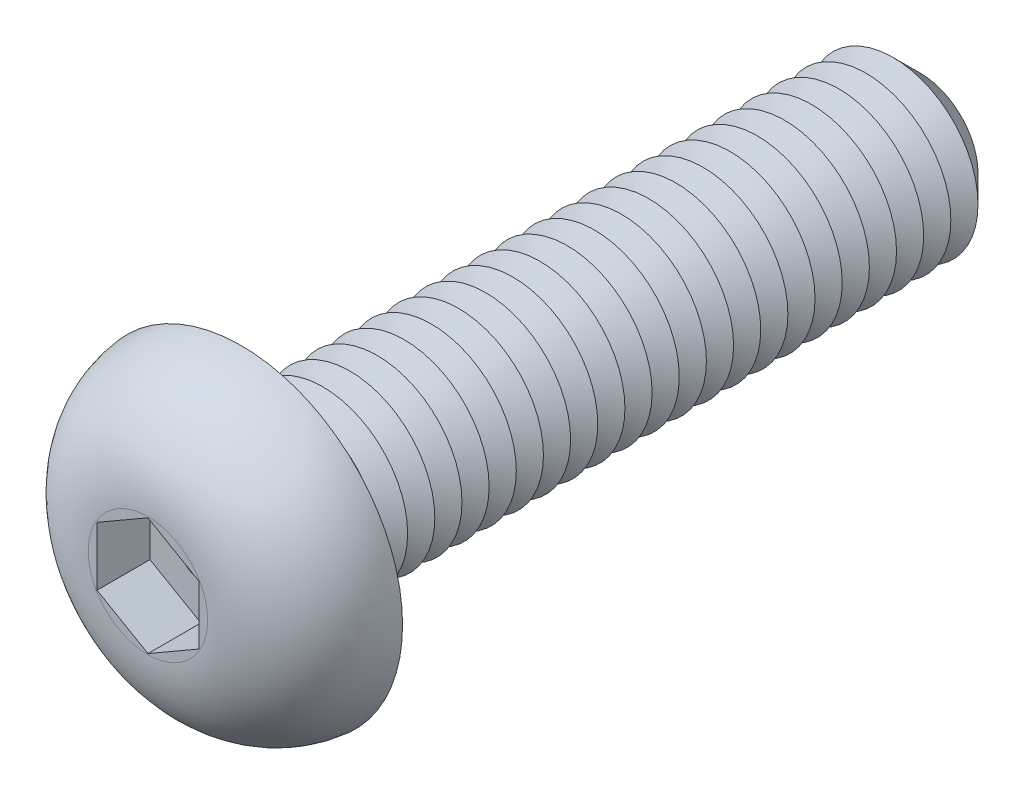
ISO-10303-21;
HEADER;
FILE_DESCRIPTION(('STEP AP214'),'2;1');
FILE_NAME('part.step','',(''),(''),'','','');
FILE_SCHEMA(('AUTOMOTIVE_DESIGN { 1 0 10303 214 1 1 1 1 }'));
ENDSEC;
DATA;
#1=APPLICATION_CONTEXT('core data for automotive mechanical design processes');
#2=APPLICATION_PROTOCOL_DEFINITION('international standard','automotive_design',2000,#1);
#3=PRODUCT_CONTEXT('',#1,'mechanical');
#4=PRODUCT('Part','Part','',(#3));
#5=PRODUCT_RELATED_PRODUCT_CATEGORY('part','',(#4));
#6=PRODUCT_DEFINITION_FORMATION('','',#4);
#7=PRODUCT_DEFINITION_CONTEXT('part definition',#1,'design');
#8=PRODUCT_DEFINITION('design','',#6,#7);
#9=PRODUCT_DEFINITION_SHAPE('','',#8);
#10=(LENGTH_UNIT() NAMED_UNIT(*) SI_UNIT(.MILLI.,.METRE.));
#11=(NAMED_UNIT(*) PLANE_ANGLE_UNIT() SI_UNIT($,.RADIAN.));
#12=(NAMED_UNIT(*) SI_UNIT($,.STERADIAN.) SOLID_ANGLE_UNIT());
#13=UNCERTAINTY_MEASURE_WITH_UNIT(LENGTH_MEASURE(1.E-05),#10,'distance_accuracy_value','');
#14=(GEOMETRIC_REPRESENTATION_CONTEXT(3) GLOBAL_UNCERTAINTY_ASSIGNED_CONTEXT((#13)) GLOBAL_UNIT_ASSIGNED_CONTEXT((#10,
#11,#12)) REPRESENTATION_CONTEXT('',''));
#15=CARTESIAN_POINT('',(0.,0.,0.));
#16=DIRECTION('',(0.,0.,1.));
#17=DIRECTION('',(1.,0.,0.));
#18=AXIS2_PLACEMENT_3D('',#15,#16,#17);
#19=CARTESIAN_POINT('',(0.,0.,-20.));
#20=DIRECTION('',(0.,0.,1.));
#21=DIRECTION('',(1.,0.,0.));
#22=AXIS2_PLACEMENT_3D('',#19,#20,#21);
#23=CYLINDRICAL_SURFACE('',#22,2.5);
#24=CARTESIAN_POINT('',(0.,0.,-0.400000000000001));
#25=DIRECTION('',(0.,0.,1.));
#26=DIRECTION('',(1.,0.,0.));
#27=AXIS2_PLACEMENT_3D('',#24,#25,#26);
#28=CIRCLE('',#27,2.5);
#29=CARTESIAN_POINT('',(2.5,0.,-0.400000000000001));
#30=VERTEX_POINT('',#29);
#31=EDGE_CURVE('E48',#30,#30,#28,.F.);
#32=ORIENTED_EDGE('',*,*,#31,.T.);
#33=EDGE_LOOP('',(#32));
#34=FACE_BOUND('',#33,.T.);
#35=CARTESIAN_POINT('',(0.,0.,-0.800000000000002));
#36=DIRECTION('',(0.,0.,1.));
#37=DIRECTION('',(1.,0.,0.));
#38=AXIS2_PLACEMENT_3D('',#35,#36,#37);
#39=CIRCLE('',#38,2.5);
#40=CARTESIAN_POINT('',(2.5,0.,-0.800000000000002));
#41=VERTEX_POINT('',#40);
#42=EDGE_CURVE('E137',#41,#41,#39,.T.);
#43=ORIENTED_EDGE('',*,*,#42,.T.);
#44=EDGE_LOOP('',(#43));
#45=FACE_BOUND('',#44,.T.);
#46=ADVANCED_FACE('F39',(#34,#45),#23,.T.);
#47=CARTESIAN_POINT('',(0.,4.75,0.));
#48=DIRECTION('',(0.,0.,1.));
#49=DIRECTION('',(1.,0.,0.));
#50=AXIS2_PLACEMENT_3D('',#47,#48,#49);
#51=PLANE('',#50);
#52=CARTESIAN_POINT('',(0.,0.,0.));
#53=DIRECTION('',(0.,0.,1.));
#54=DIRECTION('',(1.,0.,0.));
#55=AXIS2_PLACEMENT_3D('',#52,#53,#54);
#56=CIRCLE('',#55,2.9);
#57=CARTESIAN_POINT('',(2.9,0.,0.));
#58=VERTEX_POINT('',#57);
#59=EDGE_CURVE('E11',#58,#58,#56,.T.);
#60=ORIENTED_EDGE('',*,*,#59,.T.);
#61=EDGE_LOOP('',(#60));
#62=FACE_BOUND('',#61,.T.);
#63=CARTESIAN_POINT('',(0.,0.,0.));
#64=DIRECTION('',(0.,0.,1.));
#65=DIRECTION('',(1.,0.,0.));
#66=AXIS2_PLACEMENT_3D('',#63,#64,#65);
#67=CIRCLE('',#66,4.75);
#68=CARTESIAN_POINT('',(4.75,0.,0.));
#69=VERTEX_POINT('',#68);
#70=EDGE_CURVE('E156',#69,#69,#67,.T.);
#71=ORIENTED_EDGE('',*,*,#70,.F.);
#72=EDGE_LOOP('',(#71));
#73=FACE_BOUND('',#72,.T.);
#74=ADVANCED_FACE('F197',(#62,#73),#51,.F.);
#75=CARTESIAN_POINT('',(0.,0.,2.75));
#76=DIRECTION('',(0.,0.,-1.));
#77=DIRECTION('',(-1.,0.,0.));
#78=AXIS2_PLACEMENT_3D('',#75,#76,#77);
#79=PLANE('',#78);
#80=DIRECTION('',(-0.866025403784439,-0.5,0.));
#81=VECTOR('',#80,1.);
#82=CARTESIAN_POINT('',(0.,1.73205080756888,2.75));
#83=LINE('',#82,#81);
#84=CARTESIAN_POINT('',(0.,1.73205080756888,2.75));
#85=VERTEX_POINT('',#84);
#86=CARTESIAN_POINT('',(-1.5,0.866025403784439,2.75));
#87=VERTEX_POINT('',#86);
#88=EDGE_CURVE('E136',#85,#87,#83,.T.);
#89=ORIENTED_EDGE('',*,*,#88,.F.);
#90=DIRECTION('',(-0.866025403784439,0.5,0.));
#91=VECTOR('',#90,1.);
#92=CARTESIAN_POINT('',(1.5,0.86602540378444,2.75));
#93=LINE('',#92,#91);
#94=CARTESIAN_POINT('',(1.5,0.86602540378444,2.75));
#95=VERTEX_POINT('',#94);
#96=EDGE_CURVE('E55',#95,#85,#93,.T.);
#97=ORIENTED_EDGE('',*,*,#96,.F.);
#98=DIRECTION('',(0.,1.,0.));
#99=VECTOR('',#98,1.);
#100=CARTESIAN_POINT('',(1.5,-0.866025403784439,2.75));
#101=LINE('',#100,#99);
#102=CARTESIAN_POINT('',(1.5,-0.866025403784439,2.75));
#103=VERTEX_POINT('',#102);
#104=EDGE_CURVE('E150',#103,#95,#101,.T.);
#105=ORIENTED_EDGE('',*,*,#104,.F.);
#106=DIRECTION('',(0.866025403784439,0.5,0.));
#107=VECTOR('',#106,1.);
#108=CARTESIAN_POINT('',(0.,-1.73205080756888,2.75));
#109=LINE('',#108,#107);
#110=CARTESIAN_POINT('',(0.,-1.73205080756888,2.75));
#111=VERTEX_POINT('',#110);
#112=EDGE_CURVE('E147',#111,#103,#109,.T.);
#113=ORIENTED_EDGE('',*,*,#112,.F.);
#114=DIRECTION('',(0.866025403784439,-0.5,0.));
#115=VECTOR('',#114,1.);
#116=CARTESIAN_POINT('',(-1.5,-0.866025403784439,2.75));
#117=LINE('',#116,#115);
#118=CARTESIAN_POINT('',(-1.5,-0.866025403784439,2.75));
#119=VERTEX_POINT('',#118);
#120=EDGE_CURVE('E103',#119,#111,#117,.T.);
#121=ORIENTED_EDGE('',*,*,#120,.F.);
#122=DIRECTION('',(0.,-1.,0.));
#123=VECTOR('',#122,1.);
#124=CARTESIAN_POINT('',(-1.5,0.866025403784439,2.75));
#125=LINE('',#124,#123);
#126=EDGE_CURVE('E141',#87,#119,#125,.T.);
#127=ORIENTED_EDGE('',*,*,#126,.F.);
#128=EDGE_LOOP('',(#89,#97,#105,#113,#121,#127));
#129=FACE_BOUND('',#128,.T.);
#130=CARTESIAN_POINT('',(0.,0.,2.75));
#131=DIRECTION('',(0.,0.,1.));
#132=DIRECTION('',(1.,0.,0.));
#133=AXIS2_PLACEMENT_3D('',#130,#131,#132);
#134=CIRCLE('',#133,1.76043481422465);
#135=CARTESIAN_POINT('',(1.76043481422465,0.,2.75));
#136=VERTEX_POINT('',#135);
#137=EDGE_CURVE('E169',#136,#136,#134,.T.);
#138=ORIENTED_EDGE('',*,*,#137,.T.);
#139=EDGE_LOOP('',(#138));
#140=FACE_BOUND('',#139,.T.);
#141=ADVANCED_FACE('F202',(#129,#140),#79,.F.);
#142=CARTESIAN_POINT('',(0.,0.,-0.25));
#143=DIRECTION('',(0.,0.,1.));
#144=DIRECTION('',(1.,0.,0.));
#145=AXIS2_PLACEMENT_3D('',#142,#143,#144);
#146=DEGENERATE_TOROIDAL_SURFACE('',#145,1.76043481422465,3.,.T.);
#147=ORIENTED_EDGE('',*,*,#137,.F.);
#148=EDGE_LOOP('',(#147));
#149=FACE_BOUND('',#148,.T.);
#150=ORIENTED_EDGE('',*,*,#70,.T.);
#151=EDGE_LOOP('',(#150));
#152=FACE_BOUND('',#151,.T.);
#153=ADVANCED_FACE('F230',(#149,#152),#146,.T.);
#154=CARTESIAN_POINT('',(1.5,0.86602540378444,1.19));
#155=DIRECTION('',(0.5,0.866025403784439,0.));
#156=DIRECTION('',(-0.866025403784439,0.5,0.));
#157=AXIS2_PLACEMENT_3D('',#154,#155,#156);
#158=PLANE('',#157);
#159=ORIENTED_EDGE('',*,*,#96,.T.);
#160=DIRECTION('',(0.,0.,1.));
#161=VECTOR('',#160,1.);
#162=CARTESIAN_POINT('',(0.,1.73205080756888,1.19));
#163=LINE('',#162,#161);
#164=CARTESIAN_POINT('',(0.,1.73205080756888,1.19));
#165=VERTEX_POINT('',#164);
#166=EDGE_CURVE('E85',#165,#85,#163,.T.);
#167=ORIENTED_EDGE('',*,*,#166,.F.);
#168=DIRECTION('',(-0.866025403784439,0.5,0.));
#169=VECTOR('',#168,1.);
#170=CARTESIAN_POINT('',(1.5,0.86602540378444,1.19));
#171=LINE('',#170,#169);
#172=CARTESIAN_POINT('',(1.5,0.86602540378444,1.19));
#173=VERTEX_POINT('',#172);
#174=EDGE_CURVE('E153',#173,#165,#171,.T.);
#175=ORIENTED_EDGE('',*,*,#174,.F.);
#176=DIRECTION('',(0.,0.,1.));
#177=VECTOR('',#176,1.);
#178=CARTESIAN_POINT('',(1.5,0.86602540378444,1.19));
#179=LINE('',#178,#177);
#180=EDGE_CURVE('E63',#173,#95,#179,.T.);
#181=ORIENTED_EDGE('',*,*,#180,.T.);
#182=EDGE_LOOP('',(#159,#167,#175,#181));
#183=FACE_BOUND('',#182,.T.);
#184=ADVANCED_FACE('F216',(#183),#158,.F.);
#185=CARTESIAN_POINT('',(1.5,-0.866025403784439,1.19));
#186=DIRECTION('',(1.,0.,0.));
#187=DIRECTION('',(0.,1.,0.));
#188=AXIS2_PLACEMENT_3D('',#185,#186,#187);
#189=PLANE('',#188);
#190=ORIENTED_EDGE('',*,*,#104,.T.);
#191=ORIENTED_EDGE('',*,*,#180,.F.);
#192=DIRECTION('',(0.,1.,0.));
#193=VECTOR('',#192,1.);
#194=CARTESIAN_POINT('',(1.5,-0.866025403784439,1.19));
#195=LINE('',#194,#193);
#196=CARTESIAN_POINT('',(1.5,-0.866025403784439,1.19));
#197=VERTEX_POINT('',#196);
#198=EDGE_CURVE('E117',#197,#173,#195,.T.);
#199=ORIENTED_EDGE('',*,*,#198,.F.);
#200=DIRECTION('',(0.,0.,1.));
#201=VECTOR('',#200,1.);
#202=CARTESIAN_POINT('',(1.5,-0.866025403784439,1.19));
#203=LINE('',#202,#201);
#204=EDGE_CURVE('E108',#197,#103,#203,.T.);
#205=ORIENTED_EDGE('',*,*,#204,.T.);
#206=EDGE_LOOP('',(#190,#191,#199,#205));
#207=FACE_BOUND('',#206,.T.);
#208=ADVANCED_FACE('F213',(#207),#189,.F.);
#209=CARTESIAN_POINT('',(0.,-1.73205080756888,1.19));
#210=DIRECTION('',(0.5,-0.866025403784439,0.));
#211=DIRECTION('',(0.866025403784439,0.5,0.));
#212=AXIS2_PLACEMENT_3D('',#209,#210,#211);
#213=PLANE('',#212);
#214=ORIENTED_EDGE('',*,*,#112,.T.);
#215=ORIENTED_EDGE('',*,*,#204,.F.);
#216=DIRECTION('',(0.866025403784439,0.5,0.));
#217=VECTOR('',#216,1.);
#218=CARTESIAN_POINT('',(0.,-1.73205080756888,1.19));
#219=LINE('',#218,#217);
#220=CARTESIAN_POINT('',(0.,-1.73205080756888,1.19));
#221=VERTEX_POINT('',#220);
#222=EDGE_CURVE('E112',#221,#197,#219,.T.);
#223=ORIENTED_EDGE('',*,*,#222,.F.);
#224=DIRECTION('',(0.,0.,1.));
#225=VECTOR('',#224,1.);
#226=CARTESIAN_POINT('',(0.,-1.73205080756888,1.19));
#227=LINE('',#226,#225);
#228=EDGE_CURVE('E96',#221,#111,#227,.T.);
#229=ORIENTED_EDGE('',*,*,#228,.T.);
#230=EDGE_LOOP('',(#214,#215,#223,#229));
#231=FACE_BOUND('',#230,.T.);
#232=ADVANCED_FACE('F113',(#231),#213,.F.);
#233=CARTESIAN_POINT('',(-1.5,-0.866025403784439,1.19));
#234=DIRECTION('',(-0.5,-0.866025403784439,0.));
#235=DIRECTION('',(0.866025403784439,-0.5,0.));
#236=AXIS2_PLACEMENT_3D('',#233,#234,#235);
#237=PLANE('',#236);
#238=ORIENTED_EDGE('',*,*,#120,.T.);
#239=ORIENTED_EDGE('',*,*,#228,.F.);
#240=DIRECTION('',(0.866025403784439,-0.5,0.));
#241=VECTOR('',#240,1.);
#242=CARTESIAN_POINT('',(-1.5,-0.866025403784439,1.19));
#243=LINE('',#242,#241);
#244=CARTESIAN_POINT('',(-1.5,-0.866025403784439,1.19));
#245=VERTEX_POINT('',#244);
#246=EDGE_CURVE('E100',#245,#221,#243,.T.);
#247=ORIENTED_EDGE('',*,*,#246,.F.);
#248=DIRECTION('',(0.,0.,1.));
#249=VECTOR('',#248,1.);
#250=CARTESIAN_POINT('',(-1.5,-0.866025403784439,1.19));
#251=LINE('',#250,#249);
#252=EDGE_CURVE('E109',#245,#119,#251,.T.);
#253=ORIENTED_EDGE('',*,*,#252,.T.);
#254=EDGE_LOOP('',(#238,#239,#247,#253));
#255=FACE_BOUND('',#254,.T.);
#256=ADVANCED_FACE('F98',(#255),#237,.F.);
#257=CARTESIAN_POINT('',(-1.5,0.866025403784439,1.19));
#258=DIRECTION('',(-1.,0.,0.));
#259=DIRECTION('',(0.,-1.,0.));
#260=AXIS2_PLACEMENT_3D('',#257,#258,#259);
#261=PLANE('',#260);
#262=ORIENTED_EDGE('',*,*,#126,.T.);
#263=ORIENTED_EDGE('',*,*,#252,.F.);
#264=DIRECTION('',(0.,-1.,0.));
#265=VECTOR('',#264,1.);
#266=CARTESIAN_POINT('',(-1.5,0.866025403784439,1.19));
#267=LINE('',#266,#265);
#268=CARTESIAN_POINT('',(-1.5,0.866025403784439,1.19));
#269=VERTEX_POINT('',#268);
#270=EDGE_CURVE('E123',#269,#245,#267,.T.);
#271=ORIENTED_EDGE('',*,*,#270,.F.);
#272=DIRECTION('',(0.,0.,1.));
#273=VECTOR('',#272,1.);
#274=CARTESIAN_POINT('',(-1.5,0.866025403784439,1.19));
#275=LINE('',#274,#273);
#276=EDGE_CURVE('E161',#269,#87,#275,.T.);
#277=ORIENTED_EDGE('',*,*,#276,.T.);
#278=EDGE_LOOP('',(#262,#263,#271,#277));
#279=FACE_BOUND('',#278,.T.);
#280=ADVANCED_FACE('F221',(#279),#261,.F.);
#281=CARTESIAN_POINT('',(0.,1.73205080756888,1.19));
#282=DIRECTION('',(-0.5,0.866025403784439,0.));
#283=DIRECTION('',(-0.866025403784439,-0.5,0.));
#284=AXIS2_PLACEMENT_3D('',#281,#282,#283);
#285=PLANE('',#284);
#286=ORIENTED_EDGE('',*,*,#88,.T.);
#287=ORIENTED_EDGE('',*,*,#276,.F.);
#288=DIRECTION('',(-0.866025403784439,-0.5,0.));
#289=VECTOR('',#288,1.);
#290=CARTESIAN_POINT('',(0.,1.73205080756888,1.19));
#291=LINE('',#290,#289);
#292=EDGE_CURVE('E129',#165,#269,#291,.T.);
#293=ORIENTED_EDGE('',*,*,#292,.F.);
#294=ORIENTED_EDGE('',*,*,#166,.T.);
#295=EDGE_LOOP('',(#286,#287,#293,#294));
#296=FACE_BOUND('',#295,.T.);
#297=ADVANCED_FACE('F211',(#296),#285,.F.);
#298=CARTESIAN_POINT('',(0.,0.,1.19));
#299=DIRECTION('',(0.,0.,1.));
#300=DIRECTION('',(1.,0.,0.));
#301=AXIS2_PLACEMENT_3D('',#298,#299,#300);
#302=PLANE('',#301);
#303=CARTESIAN_POINT('',(0.,0.,1.19));
#304=DIRECTION('',(0.,0.,1.));
#305=DIRECTION('',(1.,0.,0.));
#306=AXIS2_PLACEMENT_3D('',#303,#304,#305);
#307=CIRCLE('',#306,0.65);
#308=CARTESIAN_POINT('',(0.65,0.,1.19));
#309=VERTEX_POINT('',#308);
#310=EDGE_CURVE('E439',#309,#309,#307,.T.);
#311=ORIENTED_EDGE('',*,*,#310,.F.);
#312=EDGE_LOOP('',(#311));
#313=FACE_BOUND('',#312,.T.);
#314=ORIENTED_EDGE('',*,*,#174,.T.);
#315=ORIENTED_EDGE('',*,*,#292,.T.);
#316=ORIENTED_EDGE('',*,*,#270,.T.);
#317=ORIENTED_EDGE('',*,*,#246,.T.);
#318=ORIENTED_EDGE('',*,*,#222,.T.);
#319=ORIENTED_EDGE('',*,*,#198,.T.);
#320=EDGE_LOOP('',(#314,#315,#316,#317,#318,#319));
#321=FACE_BOUND('',#320,.T.);
#322=ADVANCED_FACE('F120',(#313,#321),#302,.T.);
#323=CARTESIAN_POINT('',(0.,0.,-0.800000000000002));
#324=DIRECTION('',(0.,0.,1.));
#325=DIRECTION('',(1.,0.,0.));
#326=AXIS2_PLACEMENT_3D('',#323,#324,#325);
#327=CONICAL_SURFACE('',#326,2.5,1.0471975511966);
#328=CARTESIAN_POINT('',(0.,0.,-1.2));
#329=DIRECTION('',(0.,0.,1.));
#330=DIRECTION('',(1.,0.,0.));
#331=AXIS2_PLACEMENT_3D('',#328,#329,#330);
#332=CIRCLE('',#331,1.80717967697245);
#333=CARTESIAN_POINT('',(1.80717967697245,0.,-1.2));
#334=VERTEX_POINT('',#333);
#335=EDGE_CURVE('E255',#334,#334,#332,.T.);
#336=ORIENTED_EDGE('',*,*,#335,.T.);
#337=EDGE_LOOP('',(#336));
#338=FACE_BOUND('',#337,.T.);
#339=ORIENTED_EDGE('',*,*,#42,.F.);
#340=EDGE_LOOP('',(#339));
#341=FACE_BOUND('',#340,.T.);
#342=ADVANCED_FACE('F210',(#338,#341),#327,.T.);
#343=CARTESIAN_POINT('',(0.,0.,-1.2));
#344=DIRECTION('',(0.,0.,-1.));
#345=DIRECTION('',(-1.,0.,0.));
#346=AXIS2_PLACEMENT_3D('',#343,#344,#345);
#347=CONICAL_SURFACE('',#346,1.80717967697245,1.0471975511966);
#348=CARTESIAN_POINT('',(0.,0.,-1.6));
#349=DIRECTION('',(0.,0.,1.));
#350=DIRECTION('',(1.,0.,0.));
#351=AXIS2_PLACEMENT_3D('',#348,#349,#350);
#352=CIRCLE('',#351,2.5);
#353=CARTESIAN_POINT('',(2.5,0.,-1.6));
#354=VERTEX_POINT('',#353);
#355=EDGE_CURVE('E259',#354,#354,#352,.T.);
#356=ORIENTED_EDGE('',*,*,#355,.T.);
#357=EDGE_LOOP('',(#356));
#358=FACE_BOUND('',#357,.T.);
#359=ORIENTED_EDGE('',*,*,#335,.F.);
#360=EDGE_LOOP('',(#359));
#361=FACE_BOUND('',#360,.T.);
#362=ADVANCED_FACE('F631',(#358,#361),#347,.T.);
#363=CARTESIAN_POINT('',(0.,0.,-1.6));
#364=DIRECTION('',(0.,0.,1.));
#365=DIRECTION('',(1.,0.,0.));
#366=AXIS2_PLACEMENT_3D('',#363,#364,#365);
#367=CONICAL_SURFACE('',#366,2.5,1.0471975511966);
#368=CARTESIAN_POINT('',(0.,0.,-2.));
#369=DIRECTION('',(0.,0.,1.));
#370=DIRECTION('',(1.,0.,0.));
#371=AXIS2_PLACEMENT_3D('',#368,#369,#370);
#372=CIRCLE('',#371,1.80717967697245);
#373=CARTESIAN_POINT('',(1.80717967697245,0.,-2.));
#374=VERTEX_POINT('',#373);
#375=EDGE_CURVE('E262',#374,#374,#372,.T.);
#376=ORIENTED_EDGE('',*,*,#375,.T.);
#377=EDGE_LOOP('',(#376));
#378=FACE_BOUND('',#377,.T.);
#379=ORIENTED_EDGE('',*,*,#355,.F.);
#380=EDGE_LOOP('',(#379));
#381=FACE_BOUND('',#380,.T.);
#382=ADVANCED_FACE('F627',(#378,#381),#367,.T.);
#383=CARTESIAN_POINT('',(0.,0.,-2.));
#384=DIRECTION('',(0.,0.,-1.));
#385=DIRECTION('',(-1.,0.,0.));
#386=AXIS2_PLACEMENT_3D('',#383,#384,#385);
#387=CONICAL_SURFACE('',#386,1.80717967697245,1.0471975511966);
#388=CARTESIAN_POINT('',(0.,0.,-2.4));
#389=DIRECTION('',(0.,0.,1.));
#390=DIRECTION('',(1.,0.,0.));
#391=AXIS2_PLACEMENT_3D('',#388,#389,#390);
#392=CIRCLE('',#391,2.5);
#393=CARTESIAN_POINT('',(2.5,0.,-2.4));
#394=VERTEX_POINT('',#393);
#395=EDGE_CURVE('E266',#394,#394,#392,.T.);
#396=ORIENTED_EDGE('',*,*,#395,.T.);
#397=EDGE_LOOP('',(#396));
#398=FACE_BOUND('',#397,.T.);
#399=ORIENTED_EDGE('',*,*,#375,.F.);
#400=EDGE_LOOP('',(#399));
#401=FACE_BOUND('',#400,.T.);
#402=ADVANCED_FACE('F623',(#398,#401),#387,.T.);
#403=CARTESIAN_POINT('',(0.,0.,-2.4));
#404=DIRECTION('',(0.,0.,1.));
#405=DIRECTION('',(1.,0.,0.));
#406=AXIS2_PLACEMENT_3D('',#403,#404,#405);
#407=CONICAL_SURFACE('',#406,2.5,1.0471975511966);
#408=CARTESIAN_POINT('',(0.,0.,-2.8));
#409=DIRECTION('',(0.,0.,1.));
#410=DIRECTION('',(1.,0.,0.));
#411=AXIS2_PLACEMENT_3D('',#408,#409,#410);
#412=CIRCLE('',#411,1.80717967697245);
#413=CARTESIAN_POINT('',(1.80717967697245,0.,-2.8));
#414=VERTEX_POINT('',#413);
#415=EDGE_CURVE('E269',#414,#414,#412,.T.);
#416=ORIENTED_EDGE('',*,*,#415,.T.);
#417=EDGE_LOOP('',(#416));
#418=FACE_BOUND('',#417,.T.);
#419=ORIENTED_EDGE('',*,*,#395,.F.);
#420=EDGE_LOOP('',(#419));
#421=FACE_BOUND('',#420,.T.);
#422=ADVANCED_FACE('F619',(#418,#421),#407,.T.);
#423=CARTESIAN_POINT('',(0.,0.,-2.8));
#424=DIRECTION('',(0.,0.,-1.));
#425=DIRECTION('',(-1.,0.,0.));
#426=AXIS2_PLACEMENT_3D('',#423,#424,#425);
#427=CONICAL_SURFACE('',#426,1.80717967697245,1.0471975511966);
#428=CARTESIAN_POINT('',(0.,0.,-3.2));
#429=DIRECTION('',(0.,0.,1.));
#430=DIRECTION('',(1.,0.,0.));
#431=AXIS2_PLACEMENT_3D('',#428,#429,#430);
#432=CIRCLE('',#431,2.5);
#433=CARTESIAN_POINT('',(2.5,0.,-3.2));
#434=VERTEX_POINT('',#433);
#435=EDGE_CURVE('E273',#434,#434,#432,.T.);
#436=ORIENTED_EDGE('',*,*,#435,.T.);
#437=EDGE_LOOP('',(#436));
#438=FACE_BOUND('',#437,.T.);
#439=ORIENTED_EDGE('',*,*,#415,.F.);
#440=EDGE_LOOP('',(#439));
#441=FACE_BOUND('',#440,.T.);
#442=ADVANCED_FACE('F615',(#438,#441),#427,.T.);
#443=CARTESIAN_POINT('',(0.,0.,-3.2));
#444=DIRECTION('',(0.,0.,1.));
#445=DIRECTION('',(1.,0.,0.));
#446=AXIS2_PLACEMENT_3D('',#443,#444,#445);
#447=CONICAL_SURFACE('',#446,2.5,1.0471975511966);
#448=CARTESIAN_POINT('',(0.,0.,-3.6));
#449=DIRECTION('',(0.,0.,1.));
#450=DIRECTION('',(1.,0.,0.));
#451=AXIS2_PLACEMENT_3D('',#448,#449,#450);
#452=CIRCLE('',#451,1.80717967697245);
#453=CARTESIAN_POINT('',(1.80717967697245,0.,-3.6));
#454=VERTEX_POINT('',#453);
#455=EDGE_CURVE('E277',#454,#454,#452,.T.);
#456=ORIENTED_EDGE('',*,*,#455,.T.);
#457=EDGE_LOOP('',(#456));
#458=FACE_BOUND('',#457,.T.);
#459=ORIENTED_EDGE('',*,*,#435,.F.);
#460=EDGE_LOOP('',(#459));
#461=FACE_BOUND('',#460,.T.);
#462=ADVANCED_FACE('F611',(#458,#461),#447,.T.);
#463=CARTESIAN_POINT('',(0.,0.,-3.6));
#464=DIRECTION('',(0.,0.,-1.));
#465=DIRECTION('',(-1.,0.,0.));
#466=AXIS2_PLACEMENT_3D('',#463,#464,#465);
#467=CONICAL_SURFACE('',#466,1.80717967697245,1.0471975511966);
#468=CARTESIAN_POINT('',(0.,0.,-4.));
#469=DIRECTION('',(0.,0.,1.));
#470=DIRECTION('',(1.,0.,0.));
#471=AXIS2_PLACEMENT_3D('',#468,#469,#470);
#472=CIRCLE('',#471,2.5);
#473=CARTESIAN_POINT('',(2.5,0.,-4.));
#474=VERTEX_POINT('',#473);
#475=EDGE_CURVE('E281',#474,#474,#472,.T.);
#476=ORIENTED_EDGE('',*,*,#475,.T.);
#477=EDGE_LOOP('',(#476));
#478=FACE_BOUND('',#477,.T.);
#479=ORIENTED_EDGE('',*,*,#455,.F.);
#480=EDGE_LOOP('',(#479));
#481=FACE_BOUND('',#480,.T.);
#482=ADVANCED_FACE('F607',(#478,#481),#467,.T.);
#483=CARTESIAN_POINT('',(0.,0.,-4.));
#484=DIRECTION('',(0.,0.,1.));
#485=DIRECTION('',(1.,0.,0.));
#486=AXIS2_PLACEMENT_3D('',#483,#484,#485);
#487=CONICAL_SURFACE('',#486,2.5,1.0471975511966);
#488=CARTESIAN_POINT('',(0.,0.,-4.4));
#489=DIRECTION('',(0.,0.,1.));
#490=DIRECTION('',(1.,0.,0.));
#491=AXIS2_PLACEMENT_3D('',#488,#489,#490);
#492=CIRCLE('',#491,1.80717967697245);
#493=CARTESIAN_POINT('',(1.80717967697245,0.,-4.4));
#494=VERTEX_POINT('',#493);
#495=EDGE_CURVE('E285',#494,#494,#492,.T.);
#496=ORIENTED_EDGE('',*,*,#495,.T.);
#497=EDGE_LOOP('',(#496));
#498=FACE_BOUND('',#497,.T.);
#499=ORIENTED_EDGE('',*,*,#475,.F.);
#500=EDGE_LOOP('',(#499));
#501=FACE_BOUND('',#500,.T.);
#502=ADVANCED_FACE('F603',(#498,#501),#487,.T.);
#503=CARTESIAN_POINT('',(0.,0.,-4.4));
#504=DIRECTION('',(0.,0.,-1.));
#505=DIRECTION('',(-1.,0.,0.));
#506=AXIS2_PLACEMENT_3D('',#503,#504,#505);
#507=CONICAL_SURFACE('',#506,1.80717967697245,1.0471975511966);
#508=CARTESIAN_POINT('',(0.,0.,-4.8));
#509=DIRECTION('',(0.,0.,1.));
#510=DIRECTION('',(1.,0.,0.));
#511=AXIS2_PLACEMENT_3D('',#508,#509,#510);
#512=CIRCLE('',#511,2.5);
#513=CARTESIAN_POINT('',(2.5,0.,-4.8));
#514=VERTEX_POINT('',#513);
#515=EDGE_CURVE('E289',#514,#514,#512,.T.);
#516=ORIENTED_EDGE('',*,*,#515,.T.);
#517=EDGE_LOOP('',(#516));
#518=FACE_BOUND('',#517,.T.);
#519=ORIENTED_EDGE('',*,*,#495,.F.);
#520=EDGE_LOOP('',(#519));
#521=FACE_BOUND('',#520,.T.);
#522=ADVANCED_FACE('F599',(#518,#521),#507,.T.);
#523=CARTESIAN_POINT('',(0.,0.,-4.8));
#524=DIRECTION('',(0.,0.,1.));
#525=DIRECTION('',(1.,0.,0.));
#526=AXIS2_PLACEMENT_3D('',#523,#524,#525);
#527=CONICAL_SURFACE('',#526,2.5,1.0471975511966);
#528=CARTESIAN_POINT('',(0.,0.,-5.2));
#529=DIRECTION('',(0.,0.,1.));
#530=DIRECTION('',(1.,0.,0.));
#531=AXIS2_PLACEMENT_3D('',#528,#529,#530);
#532=CIRCLE('',#531,1.80717967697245);
#533=CARTESIAN_POINT('',(1.80717967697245,0.,-5.2));
#534=VERTEX_POINT('',#533);
#535=EDGE_CURVE('E293',#534,#534,#532,.T.);
#536=ORIENTED_EDGE('',*,*,#535,.T.);
#537=EDGE_LOOP('',(#536));
#538=FACE_BOUND('',#537,.T.);
#539=ORIENTED_EDGE('',*,*,#515,.F.);
#540=EDGE_LOOP('',(#539));
#541=FACE_BOUND('',#540,.T.);
#542=ADVANCED_FACE('F595',(#538,#541),#527,.T.);
#543=CARTESIAN_POINT('',(0.,0.,-5.2));
#544=DIRECTION('',(0.,0.,-1.));
#545=DIRECTION('',(-1.,0.,0.));
#546=AXIS2_PLACEMENT_3D('',#543,#544,#545);
#547=CONICAL_SURFACE('',#546,1.80717967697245,1.0471975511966);
#548=CARTESIAN_POINT('',(0.,0.,-5.6));
#549=DIRECTION('',(0.,0.,1.));
#550=DIRECTION('',(1.,0.,0.));
#551=AXIS2_PLACEMENT_3D('',#548,#549,#550);
#552=CIRCLE('',#551,2.5);
#553=CARTESIAN_POINT('',(2.5,0.,-5.6));
#554=VERTEX_POINT('',#553);
#555=EDGE_CURVE('E297',#554,#554,#552,.T.);
#556=ORIENTED_EDGE('',*,*,#555,.T.);
#557=EDGE_LOOP('',(#556));
#558=FACE_BOUND('',#557,.T.);
#559=ORIENTED_EDGE('',*,*,#535,.F.);
#560=EDGE_LOOP('',(#559));
#561=FACE_BOUND('',#560,.T.);
#562=ADVANCED_FACE('F591',(#558,#561),#547,.T.);
#563=CARTESIAN_POINT('',(0.,0.,-5.6));
#564=DIRECTION('',(0.,0.,1.));
#565=DIRECTION('',(1.,0.,0.));
#566=AXIS2_PLACEMENT_3D('',#563,#564,#565);
#567=CONICAL_SURFACE('',#566,2.5,1.0471975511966);
#568=CARTESIAN_POINT('',(0.,0.,-6.));
#569=DIRECTION('',(0.,0.,1.));
#570=DIRECTION('',(1.,0.,0.));
#571=AXIS2_PLACEMENT_3D('',#568,#569,#570);
#572=CIRCLE('',#571,1.80717967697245);
#573=CARTESIAN_POINT('',(1.80717967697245,0.,-6.));
#574=VERTEX_POINT('',#573);
#575=EDGE_CURVE('E301',#574,#574,#572,.T.);
#576=ORIENTED_EDGE('',*,*,#575,.T.);
#577=EDGE_LOOP('',(#576));
#578=FACE_BOUND('',#577,.T.);
#579=ORIENTED_EDGE('',*,*,#555,.F.);
#580=EDGE_LOOP('',(#579));
#581=FACE_BOUND('',#580,.T.);
#582=ADVANCED_FACE('F587',(#578,#581),#567,.T.);
#583=CARTESIAN_POINT('',(0.,0.,-6.));
#584=DIRECTION('',(0.,0.,-1.));
#585=DIRECTION('',(-1.,0.,0.));
#586=AXIS2_PLACEMENT_3D('',#583,#584,#585);
#587=CONICAL_SURFACE('',#586,1.80717967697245,1.0471975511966);
#588=CARTESIAN_POINT('',(0.,0.,-6.4));
#589=DIRECTION('',(0.,0.,1.));
#590=DIRECTION('',(1.,0.,0.));
#591=AXIS2_PLACEMENT_3D('',#588,#589,#590);
#592=CIRCLE('',#591,2.5);
#593=CARTESIAN_POINT('',(2.5,0.,-6.4));
#594=VERTEX_POINT('',#593);
#595=EDGE_CURVE('E305',#594,#594,#592,.T.);
#596=ORIENTED_EDGE('',*,*,#595,.T.);
#597=EDGE_LOOP('',(#596));
#598=FACE_BOUND('',#597,.T.);
#599=ORIENTED_EDGE('',*,*,#575,.F.);
#600=EDGE_LOOP('',(#599));
#601=FACE_BOUND('',#600,.T.);
#602=ADVANCED_FACE('F583',(#598,#601),#587,.T.);
#603=CARTESIAN_POINT('',(0.,0.,-6.4));
#604=DIRECTION('',(0.,0.,1.));
#605=DIRECTION('',(1.,0.,0.));
#606=AXIS2_PLACEMENT_3D('',#603,#604,#605);
#607=CONICAL_SURFACE('',#606,2.5,1.0471975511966);
#608=CARTESIAN_POINT('',(0.,0.,-6.8));
#609=DIRECTION('',(0.,0.,1.));
#610=DIRECTION('',(1.,0.,0.));
#611=AXIS2_PLACEMENT_3D('',#608,#609,#610);
#612=CIRCLE('',#611,1.80717967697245);
#613=CARTESIAN_POINT('',(1.80717967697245,0.,-6.8));
#614=VERTEX_POINT('',#613);
#615=EDGE_CURVE('E309',#614,#614,#612,.T.);
#616=ORIENTED_EDGE('',*,*,#615,.T.);
#617=EDGE_LOOP('',(#616));
#618=FACE_BOUND('',#617,.T.);
#619=ORIENTED_EDGE('',*,*,#595,.F.);
#620=EDGE_LOOP('',(#619));
#621=FACE_BOUND('',#620,.T.);
#622=ADVANCED_FACE('F579',(#618,#621),#607,.T.);
#623=CARTESIAN_POINT('',(0.,0.,-6.8));
#624=DIRECTION('',(0.,0.,-1.));
#625=DIRECTION('',(-1.,0.,0.));
#626=AXIS2_PLACEMENT_3D('',#623,#624,#625);
#627=CONICAL_SURFACE('',#626,1.80717967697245,1.0471975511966);
#628=CARTESIAN_POINT('',(0.,0.,-7.2));
#629=DIRECTION('',(0.,0.,1.));
#630=DIRECTION('',(1.,0.,0.));
#631=AXIS2_PLACEMENT_3D('',#628,#629,#630);
#632=CIRCLE('',#631,2.5);
#633=CARTESIAN_POINT('',(2.5,0.,-7.2));
#634=VERTEX_POINT('',#633);
#635=EDGE_CURVE('E313',#634,#634,#632,.T.);
#636=ORIENTED_EDGE('',*,*,#635,.T.);
#637=EDGE_LOOP('',(#636));
#638=FACE_BOUND('',#637,.T.);
#639=ORIENTED_EDGE('',*,*,#615,.F.);
#640=EDGE_LOOP('',(#639));
#641=FACE_BOUND('',#640,.T.);
#642=ADVANCED_FACE('F575',(#638,#641),#627,.T.);
#643=CARTESIAN_POINT('',(0.,0.,-7.2));
#644=DIRECTION('',(0.,0.,1.));
#645=DIRECTION('',(1.,0.,0.));
#646=AXIS2_PLACEMENT_3D('',#643,#644,#645);
#647=CONICAL_SURFACE('',#646,2.5,1.0471975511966);
#648=CARTESIAN_POINT('',(0.,0.,-7.6));
#649=DIRECTION('',(0.,0.,1.));
#650=DIRECTION('',(1.,0.,0.));
#651=AXIS2_PLACEMENT_3D('',#648,#649,#650);
#652=CIRCLE('',#651,1.80717967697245);
#653=CARTESIAN_POINT('',(1.80717967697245,0.,-7.6));
#654=VERTEX_POINT('',#653);
#655=EDGE_CURVE('E317',#654,#654,#652,.T.);
#656=ORIENTED_EDGE('',*,*,#655,.T.);
#657=EDGE_LOOP('',(#656));
#658=FACE_BOUND('',#657,.T.);
#659=ORIENTED_EDGE('',*,*,#635,.F.);
#660=EDGE_LOOP('',(#659));
#661=FACE_BOUND('',#660,.T.);
#662=ADVANCED_FACE('F571',(#658,#661),#647,.T.);
#663=CARTESIAN_POINT('',(0.,0.,-7.6));
#664=DIRECTION('',(0.,0.,-1.));
#665=DIRECTION('',(-1.,0.,0.));
#666=AXIS2_PLACEMENT_3D('',#663,#664,#665);
#667=CONICAL_SURFACE('',#666,1.80717967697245,1.0471975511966);
#668=CARTESIAN_POINT('',(0.,0.,-8.));
#669=DIRECTION('',(0.,0.,1.));
#670=DIRECTION('',(1.,0.,0.));
#671=AXIS2_PLACEMENT_3D('',#668,#669,#670);
#672=CIRCLE('',#671,2.5);
#673=CARTESIAN_POINT('',(2.5,0.,-8.));
#674=VERTEX_POINT('',#673);
#675=EDGE_CURVE('E321',#674,#674,#672,.T.);
#676=ORIENTED_EDGE('',*,*,#675,.T.);
#677=EDGE_LOOP('',(#676));
#678=FACE_BOUND('',#677,.T.);
#679=ORIENTED_EDGE('',*,*,#655,.F.);
#680=EDGE_LOOP('',(#679));
#681=FACE_BOUND('',#680,.T.);
#682=ADVANCED_FACE('F567',(#678,#681),#667,.T.);
#683=CARTESIAN_POINT('',(0.,0.,-8.));
#684=DIRECTION('',(0.,0.,1.));
#685=DIRECTION('',(1.,0.,0.));
#686=AXIS2_PLACEMENT_3D('',#683,#684,#685);
#687=CONICAL_SURFACE('',#686,2.5,1.0471975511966);
#688=CARTESIAN_POINT('',(0.,0.,-8.4));
#689=DIRECTION('',(0.,0.,1.));
#690=DIRECTION('',(1.,0.,0.));
#691=AXIS2_PLACEMENT_3D('',#688,#689,#690);
#692=CIRCLE('',#691,1.80717967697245);
#693=CARTESIAN_POINT('',(1.80717967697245,0.,-8.4));
#694=VERTEX_POINT('',#693);
#695=EDGE_CURVE('E325',#694,#694,#692,.T.);
#696=ORIENTED_EDGE('',*,*,#695,.T.);
#697=EDGE_LOOP('',(#696));
#698=FACE_BOUND('',#697,.T.);
#699=ORIENTED_EDGE('',*,*,#675,.F.);
#700=EDGE_LOOP('',(#699));
#701=FACE_BOUND('',#700,.T.);
#702=ADVANCED_FACE('F563',(#698,#701),#687,.T.);
#703=CARTESIAN_POINT('',(0.,0.,-8.4));
#704=DIRECTION('',(0.,0.,-1.));
#705=DIRECTION('',(-1.,0.,0.));
#706=AXIS2_PLACEMENT_3D('',#703,#704,#705);
#707=CONICAL_SURFACE('',#706,1.80717967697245,1.0471975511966);
#708=CARTESIAN_POINT('',(0.,0.,-8.8));
#709=DIRECTION('',(0.,0.,1.));
#710=DIRECTION('',(1.,0.,0.));
#711=AXIS2_PLACEMENT_3D('',#708,#709,#710);
#712=CIRCLE('',#711,2.5);
#713=CARTESIAN_POINT('',(2.5,0.,-8.8));
#714=VERTEX_POINT('',#713);
#715=EDGE_CURVE('E329',#714,#714,#712,.T.);
#716=ORIENTED_EDGE('',*,*,#715,.T.);
#717=EDGE_LOOP('',(#716));
#718=FACE_BOUND('',#717,.T.);
#719=ORIENTED_EDGE('',*,*,#695,.F.);
#720=EDGE_LOOP('',(#719));
#721=FACE_BOUND('',#720,.T.);
#722=ADVANCED_FACE('F559',(#718,#721),#707,.T.);
#723=CARTESIAN_POINT('',(0.,0.,-8.8));
#724=DIRECTION('',(0.,0.,1.));
#725=DIRECTION('',(1.,0.,0.));
#726=AXIS2_PLACEMENT_3D('',#723,#724,#725);
#727=CONICAL_SURFACE('',#726,2.5,1.0471975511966);
#728=CARTESIAN_POINT('',(0.,0.,-9.2));
#729=DIRECTION('',(0.,0.,1.));
#730=DIRECTION('',(1.,0.,0.));
#731=AXIS2_PLACEMENT_3D('',#728,#729,#730);
#732=CIRCLE('',#731,1.80717967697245);
#733=CARTESIAN_POINT('',(1.80717967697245,0.,-9.2));
#734=VERTEX_POINT('',#733);
#735=EDGE_CURVE('E333',#734,#734,#732,.T.);
#736=ORIENTED_EDGE('',*,*,#735,.T.);
#737=EDGE_LOOP('',(#736));
#738=FACE_BOUND('',#737,.T.);
#739=ORIENTED_EDGE('',*,*,#715,.F.);
#740=EDGE_LOOP('',(#739));
#741=FACE_BOUND('',#740,.T.);
#742=ADVANCED_FACE('F555',(#738,#741),#727,.T.);
#743=CARTESIAN_POINT('',(0.,0.,-9.2));
#744=DIRECTION('',(0.,0.,-1.));
#745=DIRECTION('',(-1.,0.,0.));
#746=AXIS2_PLACEMENT_3D('',#743,#744,#745);
#747=CONICAL_SURFACE('',#746,1.80717967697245,1.0471975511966);
#748=CARTESIAN_POINT('',(0.,0.,-9.6));
#749=DIRECTION('',(0.,0.,1.));
#750=DIRECTION('',(1.,0.,0.));
#751=AXIS2_PLACEMENT_3D('',#748,#749,#750);
#752=CIRCLE('',#751,2.5);
#753=CARTESIAN_POINT('',(2.5,0.,-9.6));
#754=VERTEX_POINT('',#753);
#755=EDGE_CURVE('E337',#754,#754,#752,.T.);
#756=ORIENTED_EDGE('',*,*,#755,.T.);
#757=EDGE_LOOP('',(#756));
#758=FACE_BOUND('',#757,.T.);
#759=ORIENTED_EDGE('',*,*,#735,.F.);
#760=EDGE_LOOP('',(#759));
#761=FACE_BOUND('',#760,.T.);
#762=ADVANCED_FACE('F551',(#758,#761),#747,.T.);
#763=CARTESIAN_POINT('',(0.,0.,-9.6));
#764=DIRECTION('',(0.,0.,1.));
#765=DIRECTION('',(1.,0.,0.));
#766=AXIS2_PLACEMENT_3D('',#763,#764,#765);
#767=CONICAL_SURFACE('',#766,2.5,1.0471975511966);
#768=CARTESIAN_POINT('',(0.,0.,-10.));
#769=DIRECTION('',(0.,0.,1.));
#770=DIRECTION('',(1.,0.,0.));
#771=AXIS2_PLACEMENT_3D('',#768,#769,#770);
#772=CIRCLE('',#771,1.80717967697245);
#773=CARTESIAN_POINT('',(1.80717967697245,0.,-10.));
#774=VERTEX_POINT('',#773);
#775=EDGE_CURVE('E341',#774,#774,#772,.T.);
#776=ORIENTED_EDGE('',*,*,#775,.T.);
#777=EDGE_LOOP('',(#776));
#778=FACE_BOUND('',#777,.T.);
#779=ORIENTED_EDGE('',*,*,#755,.F.);
#780=EDGE_LOOP('',(#779));
#781=FACE_BOUND('',#780,.T.);
#782=ADVANCED_FACE('F547',(#778,#781),#767,.T.);
#783=CARTESIAN_POINT('',(0.,0.,-10.));
#784=DIRECTION('',(0.,0.,-1.));
#785=DIRECTION('',(-1.,0.,0.));
#786=AXIS2_PLACEMENT_3D('',#783,#784,#785);
#787=CONICAL_SURFACE('',#786,1.80717967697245,1.0471975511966);
#788=CARTESIAN_POINT('',(0.,0.,-10.4));
#789=DIRECTION('',(0.,0.,1.));
#790=DIRECTION('',(1.,0.,0.));
#791=AXIS2_PLACEMENT_3D('',#788,#789,#790);
#792=CIRCLE('',#791,2.5);
#793=CARTESIAN_POINT('',(2.5,0.,-10.4));
#794=VERTEX_POINT('',#793);
#795=EDGE_CURVE('E345',#794,#794,#792,.T.);
#796=ORIENTED_EDGE('',*,*,#795,.T.);
#797=EDGE_LOOP('',(#796));
#798=FACE_BOUND('',#797,.T.);
#799=ORIENTED_EDGE('',*,*,#775,.F.);
#800=EDGE_LOOP('',(#799));
#801=FACE_BOUND('',#800,.T.);
#802=ADVANCED_FACE('F543',(#798,#801),#787,.T.);
#803=CARTESIAN_POINT('',(0.,0.,-10.4));
#804=DIRECTION('',(0.,0.,1.));
#805=DIRECTION('',(1.,0.,0.));
#806=AXIS2_PLACEMENT_3D('',#803,#804,#805);
#807=CONICAL_SURFACE('',#806,2.5,1.0471975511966);
#808=CARTESIAN_POINT('',(0.,0.,-10.8));
#809=DIRECTION('',(0.,0.,1.));
#810=DIRECTION('',(1.,0.,0.));
#811=AXIS2_PLACEMENT_3D('',#808,#809,#810);
#812=CIRCLE('',#811,1.80717967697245);
#813=CARTESIAN_POINT('',(1.80717967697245,0.,-10.8));
#814=VERTEX_POINT('',#813);
#815=EDGE_CURVE('E349',#814,#814,#812,.T.);
#816=ORIENTED_EDGE('',*,*,#815,.T.);
#817=EDGE_LOOP('',(#816));
#818=FACE_BOUND('',#817,.T.);
#819=ORIENTED_EDGE('',*,*,#795,.F.);
#820=EDGE_LOOP('',(#819));
#821=FACE_BOUND('',#820,.T.);
#822=ADVANCED_FACE('F539',(#818,#821),#807,.T.);
#823=CARTESIAN_POINT('',(0.,0.,-10.8));
#824=DIRECTION('',(0.,0.,-1.));
#825=DIRECTION('',(-1.,0.,0.));
#826=AXIS2_PLACEMENT_3D('',#823,#824,#825);
#827=CONICAL_SURFACE('',#826,1.80717967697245,1.0471975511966);
#828=CARTESIAN_POINT('',(0.,0.,-11.2));
#829=DIRECTION('',(0.,0.,1.));
#830=DIRECTION('',(1.,0.,0.));
#831=AXIS2_PLACEMENT_3D('',#828,#829,#830);
#832=CIRCLE('',#831,2.5);
#833=CARTESIAN_POINT('',(2.5,0.,-11.2));
#834=VERTEX_POINT('',#833);
#835=EDGE_CURVE('E352',#834,#834,#832,.T.);
#836=ORIENTED_EDGE('',*,*,#835,.T.);
#837=EDGE_LOOP('',(#836));
#838=FACE_BOUND('',#837,.T.);
#839=ORIENTED_EDGE('',*,*,#815,.F.);
#840=EDGE_LOOP('',(#839));
#841=FACE_BOUND('',#840,.T.);
#842=ADVANCED_FACE('F535',(#838,#841),#827,.T.);
#843=CARTESIAN_POINT('',(0.,0.,-11.2));
#844=DIRECTION('',(0.,0.,1.));
#845=DIRECTION('',(1.,0.,0.));
#846=AXIS2_PLACEMENT_3D('',#843,#844,#845);
#847=CONICAL_SURFACE('',#846,2.5,1.0471975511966);
#848=CARTESIAN_POINT('',(0.,0.,-11.6));
#849=DIRECTION('',(0.,0.,1.));
#850=DIRECTION('',(1.,0.,0.));
#851=AXIS2_PLACEMENT_3D('',#848,#849,#850);
#852=CIRCLE('',#851,1.80717967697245);
#853=CARTESIAN_POINT('',(1.80717967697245,0.,-11.6));
#854=VERTEX_POINT('',#853);
#855=EDGE_CURVE('E356',#854,#854,#852,.T.);
#856=ORIENTED_EDGE('',*,*,#855,.T.);
#857=EDGE_LOOP('',(#856));
#858=FACE_BOUND('',#857,.T.);
#859=ORIENTED_EDGE('',*,*,#835,.F.);
#860=EDGE_LOOP('',(#859));
#861=FACE_BOUND('',#860,.T.);
#862=ADVANCED_FACE('F531',(#858,#861),#847,.T.);
#863=CARTESIAN_POINT('',(0.,0.,-11.6));
#864=DIRECTION('',(0.,0.,-1.));
#865=DIRECTION('',(-1.,0.,0.));
#866=AXIS2_PLACEMENT_3D('',#863,#864,#865);
#867=CONICAL_SURFACE('',#866,1.80717967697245,1.0471975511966);
#868=CARTESIAN_POINT('',(0.,0.,-12.));
#869=DIRECTION('',(0.,0.,1.));
#870=DIRECTION('',(1.,0.,0.));
#871=AXIS2_PLACEMENT_3D('',#868,#869,#870);
#872=CIRCLE('',#871,2.5);
#873=CARTESIAN_POINT('',(2.5,0.,-12.));
#874=VERTEX_POINT('',#873);
#875=EDGE_CURVE('E360',#874,#874,#872,.T.);
#876=ORIENTED_EDGE('',*,*,#875,.T.);
#877=EDGE_LOOP('',(#876));
#878=FACE_BOUND('',#877,.T.);
#879=ORIENTED_EDGE('',*,*,#855,.F.);
#880=EDGE_LOOP('',(#879));
#881=FACE_BOUND('',#880,.T.);
#882=ADVANCED_FACE('F527',(#878,#881),#867,.T.);
#883=CARTESIAN_POINT('',(0.,0.,-12.));
#884=DIRECTION('',(0.,0.,1.));
#885=DIRECTION('',(1.,0.,0.));
#886=AXIS2_PLACEMENT_3D('',#883,#884,#885);
#887=CONICAL_SURFACE('',#886,2.5,1.0471975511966);
#888=CARTESIAN_POINT('',(0.,0.,-12.4));
#889=DIRECTION('',(0.,0.,1.));
#890=DIRECTION('',(1.,0.,0.));
#891=AXIS2_PLACEMENT_3D('',#888,#889,#890);
#892=CIRCLE('',#891,1.80717967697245);
#893=CARTESIAN_POINT('',(1.80717967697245,0.,-12.4));
#894=VERTEX_POINT('',#893);
#895=EDGE_CURVE('E364',#894,#894,#892,.T.);
#896=ORIENTED_EDGE('',*,*,#895,.T.);
#897=EDGE_LOOP('',(#896));
#898=FACE_BOUND('',#897,.T.);
#899=ORIENTED_EDGE('',*,*,#875,.F.);
#900=EDGE_LOOP('',(#899));
#901=FACE_BOUND('',#900,.T.);
#902=ADVANCED_FACE('F523',(#898,#901),#887,.T.);
#903=CARTESIAN_POINT('',(0.,0.,-12.4));
#904=DIRECTION('',(0.,0.,-1.));
#905=DIRECTION('',(-1.,0.,0.));
#906=AXIS2_PLACEMENT_3D('',#903,#904,#905);
#907=CONICAL_SURFACE('',#906,1.80717967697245,1.0471975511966);
#908=CARTESIAN_POINT('',(0.,0.,-12.8));
#909=DIRECTION('',(0.,0.,1.));
#910=DIRECTION('',(1.,0.,0.));
#911=AXIS2_PLACEMENT_3D('',#908,#909,#910);
#912=CIRCLE('',#911,2.5);
#913=CARTESIAN_POINT('',(2.5,0.,-12.8));
#914=VERTEX_POINT('',#913);
#915=EDGE_CURVE('E368',#914,#914,#912,.T.);
#916=ORIENTED_EDGE('',*,*,#915,.T.);
#917=EDGE_LOOP('',(#916));
#918=FACE_BOUND('',#917,.T.);
#919=ORIENTED_EDGE('',*,*,#895,.F.);
#920=EDGE_LOOP('',(#919));
#921=FACE_BOUND('',#920,.T.);
#922=ADVANCED_FACE('F519',(#918,#921),#907,.T.);
#923=CARTESIAN_POINT('',(0.,0.,-12.8));
#924=DIRECTION('',(0.,0.,1.));
#925=DIRECTION('',(1.,0.,0.));
#926=AXIS2_PLACEMENT_3D('',#923,#924,#925);
#927=CONICAL_SURFACE('',#926,2.5,1.0471975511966);
#928=CARTESIAN_POINT('',(0.,0.,-13.2));
#929=DIRECTION('',(0.,0.,1.));
#930=DIRECTION('',(1.,0.,0.));
#931=AXIS2_PLACEMENT_3D('',#928,#929,#930);
#932=CIRCLE('',#931,1.80717967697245);
#933=CARTESIAN_POINT('',(1.80717967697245,0.,-13.2));
#934=VERTEX_POINT('',#933);
#935=EDGE_CURVE('E372',#934,#934,#932,.T.);
#936=ORIENTED_EDGE('',*,*,#935,.T.);
#937=EDGE_LOOP('',(#936));
#938=FACE_BOUND('',#937,.T.);
#939=ORIENTED_EDGE('',*,*,#915,.F.);
#940=EDGE_LOOP('',(#939));
#941=FACE_BOUND('',#940,.T.);
#942=ADVANCED_FACE('F515',(#938,#941),#927,.T.);
#943=CARTESIAN_POINT('',(0.,0.,-13.2));
#944=DIRECTION('',(0.,0.,-1.));
#945=DIRECTION('',(-1.,0.,0.));
#946=AXIS2_PLACEMENT_3D('',#943,#944,#945);
#947=CONICAL_SURFACE('',#946,1.80717967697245,1.0471975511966);
#948=CARTESIAN_POINT('',(0.,0.,-13.6));
#949=DIRECTION('',(0.,0.,1.));
#950=DIRECTION('',(1.,0.,0.));
#951=AXIS2_PLACEMENT_3D('',#948,#949,#950);
#952=CIRCLE('',#951,2.5);
#953=CARTESIAN_POINT('',(2.5,0.,-13.6));
#954=VERTEX_POINT('',#953);
#955=EDGE_CURVE('E376',#954,#954,#952,.T.);
#956=ORIENTED_EDGE('',*,*,#955,.T.);
#957=EDGE_LOOP('',(#956));
#958=FACE_BOUND('',#957,.T.);
#959=ORIENTED_EDGE('',*,*,#935,.F.);
#960=EDGE_LOOP('',(#959));
#961=FACE_BOUND('',#960,.T.);
#962=ADVANCED_FACE('F511',(#958,#961),#947,.T.);
#963=CARTESIAN_POINT('',(0.,0.,-13.6));
#964=DIRECTION('',(0.,0.,1.));
#965=DIRECTION('',(1.,0.,0.));
#966=AXIS2_PLACEMENT_3D('',#963,#964,#965);
#967=CONICAL_SURFACE('',#966,2.5,1.0471975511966);
#968=CARTESIAN_POINT('',(0.,0.,-14.));
#969=DIRECTION('',(0.,0.,1.));
#970=DIRECTION('',(1.,0.,0.));
#971=AXIS2_PLACEMENT_3D('',#968,#969,#970);
#972=CIRCLE('',#971,1.80717967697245);
#973=CARTESIAN_POINT('',(1.80717967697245,0.,-14.));
#974=VERTEX_POINT('',#973);
#975=EDGE_CURVE('E379',#974,#974,#972,.T.);
#976=ORIENTED_EDGE('',*,*,#975,.T.);
#977=EDGE_LOOP('',(#976));
#978=FACE_BOUND('',#977,.T.);
#979=ORIENTED_EDGE('',*,*,#955,.F.);
#980=EDGE_LOOP('',(#979));
#981=FACE_BOUND('',#980,.T.);
#982=ADVANCED_FACE('F507',(#978,#981),#967,.T.);
#983=CARTESIAN_POINT('',(0.,0.,-14.));
#984=DIRECTION('',(0.,0.,-1.));
#985=DIRECTION('',(-1.,0.,0.));
#986=AXIS2_PLACEMENT_3D('',#983,#984,#985);
#987=CONICAL_SURFACE('',#986,1.80717967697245,1.0471975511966);
#988=CARTESIAN_POINT('',(0.,0.,-14.4));
#989=DIRECTION('',(0.,0.,1.));
#990=DIRECTION('',(1.,0.,0.));
#991=AXIS2_PLACEMENT_3D('',#988,#989,#990);
#992=CIRCLE('',#991,2.5);
#993=CARTESIAN_POINT('',(2.5,0.,-14.4));
#994=VERTEX_POINT('',#993);
#995=EDGE_CURVE('E383',#994,#994,#992,.T.);
#996=ORIENTED_EDGE('',*,*,#995,.T.);
#997=EDGE_LOOP('',(#996));
#998=FACE_BOUND('',#997,.T.);
#999=ORIENTED_EDGE('',*,*,#975,.F.);
#1000=EDGE_LOOP('',(#999));
#1001=FACE_BOUND('',#1000,.T.);
#1002=ADVANCED_FACE('F503',(#998,#1001),#987,.T.);
#1003=CARTESIAN_POINT('',(0.,0.,-14.4));
#1004=DIRECTION('',(0.,0.,1.));
#1005=DIRECTION('',(1.,0.,0.));
#1006=AXIS2_PLACEMENT_3D('',#1003,#1004,#1005);
#1007=CONICAL_SURFACE('',#1006,2.5,1.0471975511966);
#1008=CARTESIAN_POINT('',(0.,0.,-14.8));
#1009=DIRECTION('',(0.,0.,1.));
#1010=DIRECTION('',(1.,0.,0.));
#1011=AXIS2_PLACEMENT_3D('',#1008,#1009,#1010);
#1012=CIRCLE('',#1011,1.80717967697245);
#1013=CARTESIAN_POINT('',(1.80717967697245,0.,-14.8));
#1014=VERTEX_POINT('',#1013);
#1015=EDGE_CURVE('E387',#1014,#1014,#1012,.T.);
#1016=ORIENTED_EDGE('',*,*,#1015,.T.);
#1017=EDGE_LOOP('',(#1016));
#1018=FACE_BOUND('',#1017,.T.);
#1019=ORIENTED_EDGE('',*,*,#995,.F.);
#1020=EDGE_LOOP('',(#1019));
#1021=FACE_BOUND('',#1020,.T.);
#1022=ADVANCED_FACE('F499',(#1018,#1021),#1007,.T.);
#1023=CARTESIAN_POINT('',(0.,0.,-14.8));
#1024=DIRECTION('',(0.,0.,-1.));
#1025=DIRECTION('',(-1.,0.,0.));
#1026=AXIS2_PLACEMENT_3D('',#1023,#1024,#1025);
#1027=CONICAL_SURFACE('',#1026,1.80717967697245,1.0471975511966);
#1028=CARTESIAN_POINT('',(0.,0.,-15.2));
#1029=DIRECTION('',(0.,0.,1.));
#1030=DIRECTION('',(1.,0.,0.));
#1031=AXIS2_PLACEMENT_3D('',#1028,#1029,#1030);
#1032=CIRCLE('',#1031,2.5);
#1033=CARTESIAN_POINT('',(2.5,0.,-15.2));
#1034=VERTEX_POINT('',#1033);
#1035=EDGE_CURVE('E391',#1034,#1034,#1032,.T.);
#1036=ORIENTED_EDGE('',*,*,#1035,.T.);
#1037=EDGE_LOOP('',(#1036));
#1038=FACE_BOUND('',#1037,.T.);
#1039=ORIENTED_EDGE('',*,*,#1015,.F.);
#1040=EDGE_LOOP('',(#1039));
#1041=FACE_BOUND('',#1040,.T.);
#1042=ADVANCED_FACE('F495',(#1038,#1041),#1027,.T.);
#1043=CARTESIAN_POINT('',(0.,0.,-15.2));
#1044=DIRECTION('',(0.,0.,1.));
#1045=DIRECTION('',(1.,0.,0.));
#1046=AXIS2_PLACEMENT_3D('',#1043,#1044,#1045);
#1047=CONICAL_SURFACE('',#1046,2.5,1.0471975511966);
#1048=CARTESIAN_POINT('',(0.,0.,-15.6));
#1049=DIRECTION('',(0.,0.,1.));
#1050=DIRECTION('',(1.,0.,0.));
#1051=AXIS2_PLACEMENT_3D('',#1048,#1049,#1050);
#1052=CIRCLE('',#1051,1.80717967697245);
#1053=CARTESIAN_POINT('',(1.80717967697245,0.,-15.6));
#1054=VERTEX_POINT('',#1053);
#1055=EDGE_CURVE('E395',#1054,#1054,#1052,.T.);
#1056=ORIENTED_EDGE('',*,*,#1055,.T.);
#1057=EDGE_LOOP('',(#1056));
#1058=FACE_BOUND('',#1057,.T.);
#1059=ORIENTED_EDGE('',*,*,#1035,.F.);
#1060=EDGE_LOOP('',(#1059));
#1061=FACE_BOUND('',#1060,.T.);
#1062=ADVANCED_FACE('F491',(#1058,#1061),#1047,.T.);
#1063=CARTESIAN_POINT('',(0.,0.,-15.6));
#1064=DIRECTION('',(0.,0.,-1.));
#1065=DIRECTION('',(-1.,0.,0.));
#1066=AXIS2_PLACEMENT_3D('',#1063,#1064,#1065);
#1067=CONICAL_SURFACE('',#1066,1.80717967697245,1.0471975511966);
#1068=CARTESIAN_POINT('',(0.,0.,-16.));
#1069=DIRECTION('',(0.,0.,1.));
#1070=DIRECTION('',(1.,0.,0.));
#1071=AXIS2_PLACEMENT_3D('',#1068,#1069,#1070);
#1072=CIRCLE('',#1071,2.5);
#1073=CARTESIAN_POINT('',(2.5,0.,-16.));
#1074=VERTEX_POINT('',#1073);
#1075=EDGE_CURVE('E399',#1074,#1074,#1072,.T.);
#1076=ORIENTED_EDGE('',*,*,#1075,.T.);
#1077=EDGE_LOOP('',(#1076));
#1078=FACE_BOUND('',#1077,.T.);
#1079=ORIENTED_EDGE('',*,*,#1055,.F.);
#1080=EDGE_LOOP('',(#1079));
#1081=FACE_BOUND('',#1080,.T.);
#1082=ADVANCED_FACE('F487',(#1078,#1081),#1067,.T.);
#1083=CARTESIAN_POINT('',(0.,0.,-16.));
#1084=DIRECTION('',(0.,0.,1.));
#1085=DIRECTION('',(1.,0.,0.));
#1086=AXIS2_PLACEMENT_3D('',#1083,#1084,#1085);
#1087=CONICAL_SURFACE('',#1086,2.5,1.0471975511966);
#1088=CARTESIAN_POINT('',(0.,0.,-16.4));
#1089=DIRECTION('',(0.,0.,1.));
#1090=DIRECTION('',(1.,0.,0.));
#1091=AXIS2_PLACEMENT_3D('',#1088,#1089,#1090);
#1092=CIRCLE('',#1091,1.80717967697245);
#1093=CARTESIAN_POINT('',(1.80717967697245,0.,-16.4));
#1094=VERTEX_POINT('',#1093);
#1095=EDGE_CURVE('E403',#1094,#1094,#1092,.T.);
#1096=ORIENTED_EDGE('',*,*,#1095,.T.);
#1097=EDGE_LOOP('',(#1096));
#1098=FACE_BOUND('',#1097,.T.);
#1099=ORIENTED_EDGE('',*,*,#1075,.F.);
#1100=EDGE_LOOP('',(#1099));
#1101=FACE_BOUND('',#1100,.T.);
#1102=ADVANCED_FACE('F483',(#1098,#1101),#1087,.T.);
#1103=CARTESIAN_POINT('',(0.,0.,-16.4));
#1104=DIRECTION('',(0.,0.,-1.));
#1105=DIRECTION('',(-1.,0.,0.));
#1106=AXIS2_PLACEMENT_3D('',#1103,#1104,#1105);
#1107=CONICAL_SURFACE('',#1106,1.80717967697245,1.0471975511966);
#1108=CARTESIAN_POINT('',(0.,0.,-16.8));
#1109=DIRECTION('',(0.,0.,1.));
#1110=DIRECTION('',(1.,0.,0.));
#1111=AXIS2_PLACEMENT_3D('',#1108,#1109,#1110);
#1112=CIRCLE('',#1111,2.5);
#1113=CARTESIAN_POINT('',(2.5,0.,-16.8));
#1114=VERTEX_POINT('',#1113);
#1115=EDGE_CURVE('E407',#1114,#1114,#1112,.T.);
#1116=ORIENTED_EDGE('',*,*,#1115,.T.);
#1117=EDGE_LOOP('',(#1116));
#1118=FACE_BOUND('',#1117,.T.);
#1119=ORIENTED_EDGE('',*,*,#1095,.F.);
#1120=EDGE_LOOP('',(#1119));
#1121=FACE_BOUND('',#1120,.T.);
#1122=ADVANCED_FACE('F479',(#1118,#1121),#1107,.T.);
#1123=CARTESIAN_POINT('',(0.,0.,-16.8));
#1124=DIRECTION('',(0.,0.,1.));
#1125=DIRECTION('',(1.,0.,0.));
#1126=AXIS2_PLACEMENT_3D('',#1123,#1124,#1125);
#1127=CONICAL_SURFACE('',#1126,2.5,1.0471975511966);
#1128=CARTESIAN_POINT('',(0.,0.,-17.2));
#1129=DIRECTION('',(0.,0.,1.));
#1130=DIRECTION('',(1.,0.,0.));
#1131=AXIS2_PLACEMENT_3D('',#1128,#1129,#1130);
#1132=CIRCLE('',#1131,1.80717967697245);
#1133=CARTESIAN_POINT('',(1.80717967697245,0.,-17.2));
#1134=VERTEX_POINT('',#1133);
#1135=EDGE_CURVE('E411',#1134,#1134,#1132,.T.);
#1136=ORIENTED_EDGE('',*,*,#1135,.T.);
#1137=EDGE_LOOP('',(#1136));
#1138=FACE_BOUND('',#1137,.T.);
#1139=ORIENTED_EDGE('',*,*,#1115,.F.);
#1140=EDGE_LOOP('',(#1139));
#1141=FACE_BOUND('',#1140,.T.);
#1142=ADVANCED_FACE('F475',(#1138,#1141),#1127,.T.);
#1143=CARTESIAN_POINT('',(0.,0.,-17.2));
#1144=DIRECTION('',(0.,0.,-1.));
#1145=DIRECTION('',(-1.,0.,0.));
#1146=AXIS2_PLACEMENT_3D('',#1143,#1144,#1145);
#1147=CONICAL_SURFACE('',#1146,1.80717967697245,1.0471975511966);
#1148=CARTESIAN_POINT('',(0.,0.,-17.6));
#1149=DIRECTION('',(0.,0.,1.));
#1150=DIRECTION('',(1.,0.,0.));
#1151=AXIS2_PLACEMENT_3D('',#1148,#1149,#1150);
#1152=CIRCLE('',#1151,2.5);
#1153=CARTESIAN_POINT('',(2.5,0.,-17.6));
#1154=VERTEX_POINT('',#1153);
#1155=EDGE_CURVE('E415',#1154,#1154,#1152,.T.);
#1156=ORIENTED_EDGE('',*,*,#1155,.T.);
#1157=EDGE_LOOP('',(#1156));
#1158=FACE_BOUND('',#1157,.T.);
#1159=ORIENTED_EDGE('',*,*,#1135,.F.);
#1160=EDGE_LOOP('',(#1159));
#1161=FACE_BOUND('',#1160,.T.);
#1162=ADVANCED_FACE('F471',(#1158,#1161),#1147,.T.);
#1163=CARTESIAN_POINT('',(0.,0.,-17.6));
#1164=DIRECTION('',(0.,0.,1.));
#1165=DIRECTION('',(1.,0.,0.));
#1166=AXIS2_PLACEMENT_3D('',#1163,#1164,#1165);
#1167=CONICAL_SURFACE('',#1166,2.5,1.0471975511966);
#1168=CARTESIAN_POINT('',(0.,0.,-18.));
#1169=DIRECTION('',(0.,0.,1.));
#1170=DIRECTION('',(1.,0.,0.));
#1171=AXIS2_PLACEMENT_3D('',#1168,#1169,#1170);
#1172=CIRCLE('',#1171,1.80717967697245);
#1173=CARTESIAN_POINT('',(1.80717967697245,0.,-18.));
#1174=VERTEX_POINT('',#1173);
#1175=EDGE_CURVE('E419',#1174,#1174,#1172,.T.);
#1176=ORIENTED_EDGE('',*,*,#1175,.T.);
#1177=EDGE_LOOP('',(#1176));
#1178=FACE_BOUND('',#1177,.T.);
#1179=ORIENTED_EDGE('',*,*,#1155,.F.);
#1180=EDGE_LOOP('',(#1179));
#1181=FACE_BOUND('',#1180,.T.);
#1182=ADVANCED_FACE('F467',(#1178,#1181),#1167,.T.);
#1183=CARTESIAN_POINT('',(0.,0.,-18.));
#1184=DIRECTION('',(0.,0.,-1.));
#1185=DIRECTION('',(-1.,0.,0.));
#1186=AXIS2_PLACEMENT_3D('',#1183,#1184,#1185);
#1187=CONICAL_SURFACE('',#1186,1.80717967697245,1.0471975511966);
#1188=CARTESIAN_POINT('',(0.,0.,-18.4));
#1189=DIRECTION('',(0.,0.,1.));
#1190=DIRECTION('',(1.,0.,0.));
#1191=AXIS2_PLACEMENT_3D('',#1188,#1189,#1190);
#1192=CIRCLE('',#1191,2.5);
#1193=CARTESIAN_POINT('',(2.5,0.,-18.4));
#1194=VERTEX_POINT('',#1193);
#1195=EDGE_CURVE('E423',#1194,#1194,#1192,.T.);
#1196=ORIENTED_EDGE('',*,*,#1195,.T.);
#1197=EDGE_LOOP('',(#1196));
#1198=FACE_BOUND('',#1197,.T.);
#1199=ORIENTED_EDGE('',*,*,#1175,.F.);
#1200=EDGE_LOOP('',(#1199));
#1201=FACE_BOUND('',#1200,.T.);
#1202=ADVANCED_FACE('F460',(#1198,#1201),#1187,.T.);
#1203=CARTESIAN_POINT('',(0.,0.,-18.4));
#1204=DIRECTION('',(0.,0.,1.));
#1205=DIRECTION('',(1.,0.,0.));
#1206=AXIS2_PLACEMENT_3D('',#1203,#1204,#1205);
#1207=CONICAL_SURFACE('',#1206,2.5,1.0471975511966);
#1208=CARTESIAN_POINT('',(0.,0.,-18.8));
#1209=DIRECTION('',(0.,0.,1.));
#1210=DIRECTION('',(1.,0.,0.));
#1211=AXIS2_PLACEMENT_3D('',#1208,#1209,#1210);
#1212=CIRCLE('',#1211,1.80717967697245);
#1213=CARTESIAN_POINT('',(1.80717967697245,0.,-18.8));
#1214=VERTEX_POINT('',#1213);
#1215=EDGE_CURVE('E431',#1214,#1214,#1212,.T.);
#1216=ORIENTED_EDGE('',*,*,#1215,.T.);
#1217=EDGE_LOOP('',(#1216));
#1218=FACE_BOUND('',#1217,.T.);
#1219=ORIENTED_EDGE('',*,*,#1195,.F.);
#1220=EDGE_LOOP('',(#1219));
#1221=FACE_BOUND('',#1220,.T.);
#1222=ADVANCED_FACE('F454',(#1218,#1221),#1207,.T.);
#1223=CARTESIAN_POINT('',(0.,0.,-18.8));
#1224=DIRECTION('',(0.,0.,-1.));
#1225=DIRECTION('',(-1.,0.,0.));
#1226=AXIS2_PLACEMENT_3D('',#1223,#1224,#1225);
#1227=CONICAL_SURFACE('',#1226,1.80717967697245,1.0471975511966);
#1228=CARTESIAN_POINT('',(0.,0.,-19.2));
#1229=DIRECTION('',(0.,0.,1.));
#1230=DIRECTION('',(1.,0.,0.));
#1231=AXIS2_PLACEMENT_3D('',#1228,#1229,#1230);
#1232=CIRCLE('',#1231,2.5);
#1233=CARTESIAN_POINT('',(2.5,0.,-19.2));
#1234=VERTEX_POINT('',#1233);
#1235=EDGE_CURVE('E427',#1234,#1234,#1232,.T.);
#1236=ORIENTED_EDGE('',*,*,#1235,.T.);
#1237=EDGE_LOOP('',(#1236));
#1238=FACE_BOUND('',#1237,.T.);
#1239=ORIENTED_EDGE('',*,*,#1215,.F.);
#1240=EDGE_LOOP('',(#1239));
#1241=FACE_BOUND('',#1240,.T.);
#1242=ADVANCED_FACE('F448',(#1238,#1241),#1227,.T.);
#1243=CARTESIAN_POINT('',(0.,0.,-20.));
#1244=DIRECTION('',(0.,0.,-1.));
#1245=DIRECTION('',(-1.,0.,0.));
#1246=AXIS2_PLACEMENT_3D('',#1243,#1244,#1245);
#1247=PLANE('',#1246);
#1248=CARTESIAN_POINT('',(0.,0.,-20.));
#1249=DIRECTION('',(0.,0.,-1.));
#1250=DIRECTION('',(-1.,0.,0.));
#1251=AXIS2_PLACEMENT_3D('',#1248,#1249,#1250);
#1252=CIRCLE('',#1251,0.65);
#1253=CARTESIAN_POINT('',(-0.65,0.,-20.));
#1254=VERTEX_POINT('',#1253);
#1255=EDGE_CURVE('E435',#1254,#1254,#1252,.F.);
#1256=ORIENTED_EDGE('',*,*,#1255,.T.);
#1257=EDGE_LOOP('',(#1256));
#1258=FACE_BOUND('',#1257,.T.);
#1259=CARTESIAN_POINT('',(0.,0.,-20.));
#1260=DIRECTION('',(0.,0.,-1.));
#1261=DIRECTION('',(-1.,0.,0.));
#1262=AXIS2_PLACEMENT_3D('',#1259,#1260,#1261);
#1263=CIRCLE('',#1262,1.7);
#1264=CARTESIAN_POINT('',(-1.7,0.,-20.));
#1265=VERTEX_POINT('',#1264);
#1266=EDGE_CURVE('E173',#1265,#1265,#1263,.T.);
#1267=ORIENTED_EDGE('',*,*,#1266,.T.);
#1268=EDGE_LOOP('',(#1267));
#1269=FACE_BOUND('',#1268,.T.);
#1270=ADVANCED_FACE('F193',(#1258,#1269),#1247,.T.);
#1271=CARTESIAN_POINT('',(0.,0.,-20.));
#1272=DIRECTION('',(0.,0.,1.));
#1273=DIRECTION('',(1.,0.,0.));
#1274=AXIS2_PLACEMENT_3D('',#1271,#1272,#1273);
#1275=CONICAL_SURFACE('',#1274,1.7,0.785398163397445);
#1276=ORIENTED_EDGE('',*,*,#1235,.F.);
#1277=EDGE_LOOP('',(#1276));
#1278=FACE_BOUND('',#1277,.T.);
#1279=ORIENTED_EDGE('',*,*,#1266,.F.);
#1280=EDGE_LOOP('',(#1279));
#1281=FACE_BOUND('',#1280,.T.);
#1282=ADVANCED_FACE('F185',(#1278,#1281),#1275,.T.);
#1283=CARTESIAN_POINT('',(0.,0.,-0.400000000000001));
#1284=DIRECTION('',(0.,0.,1.));
#1285=DIRECTION('',(1.,0.,0.));
#1286=AXIS2_PLACEMENT_3D('',#1283,#1284,#1285);
#1287=TOROIDAL_SURFACE('',#1286,2.9,0.4);
#1288=ORIENTED_EDGE('',*,*,#59,.F.);
#1289=EDGE_LOOP('',(#1288));
#1290=FACE_BOUND('',#1289,.T.);
#1291=ORIENTED_EDGE('',*,*,#31,.F.);
#1292=EDGE_LOOP('',(#1291));
#1293=FACE_BOUND('',#1292,.T.);
#1294=ADVANCED_FACE('F41',(#1290,#1293),#1287,.F.);
#1295=CARTESIAN_POINT('',(0.,0.,-21.838477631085));
#1296=DIRECTION('',(0.,0.,1.));
#1297=DIRECTION('',(1.,0.,0.));
#1298=AXIS2_PLACEMENT_3D('',#1295,#1296,#1297);
#1299=CYLINDRICAL_SURFACE('',#1298,0.65);
#1300=ORIENTED_EDGE('',*,*,#310,.T.);
#1301=EDGE_LOOP('',(#1300));
#1302=FACE_BOUND('',#1301,.T.);
#1303=ORIENTED_EDGE('',*,*,#1255,.F.);
#1304=EDGE_LOOP('',(#1303));
#1305=FACE_BOUND('',#1304,.T.);
#1306=ADVANCED_FACE('F184',(#1302,#1305),#1299,.F.);
#1307=CLOSED_SHELL('',(#46,#74,#141,#153,#184,#208,#232,#256,#280,#297,#322,#342,#362,#382,#402,
#422,#442,#462,#482,#502,#522,#542,#562,#582,#602,#622,#642,#662,#682,#702,#722,#742,#762,#782,
#802,#822,#842,#862,#882,#902,#922,#942,#962,#982,#1002,#1022,#1042,#1062,#1082,#1102,#1122,
#1142,#1162,#1182,#1202,#1222,#1242,#1270,#1282,#1294,#1306));
#1308=MANIFOLD_SOLID_BREP('B2',#1307);
#1309=ADVANCED_BREP_SHAPE_REPRESENTATION('',(#18,#1308),#14);
#1310=SHAPE_DEFINITION_REPRESENTATION(#9,#1309);
ENDSEC;
END-ISO-10303-21;
